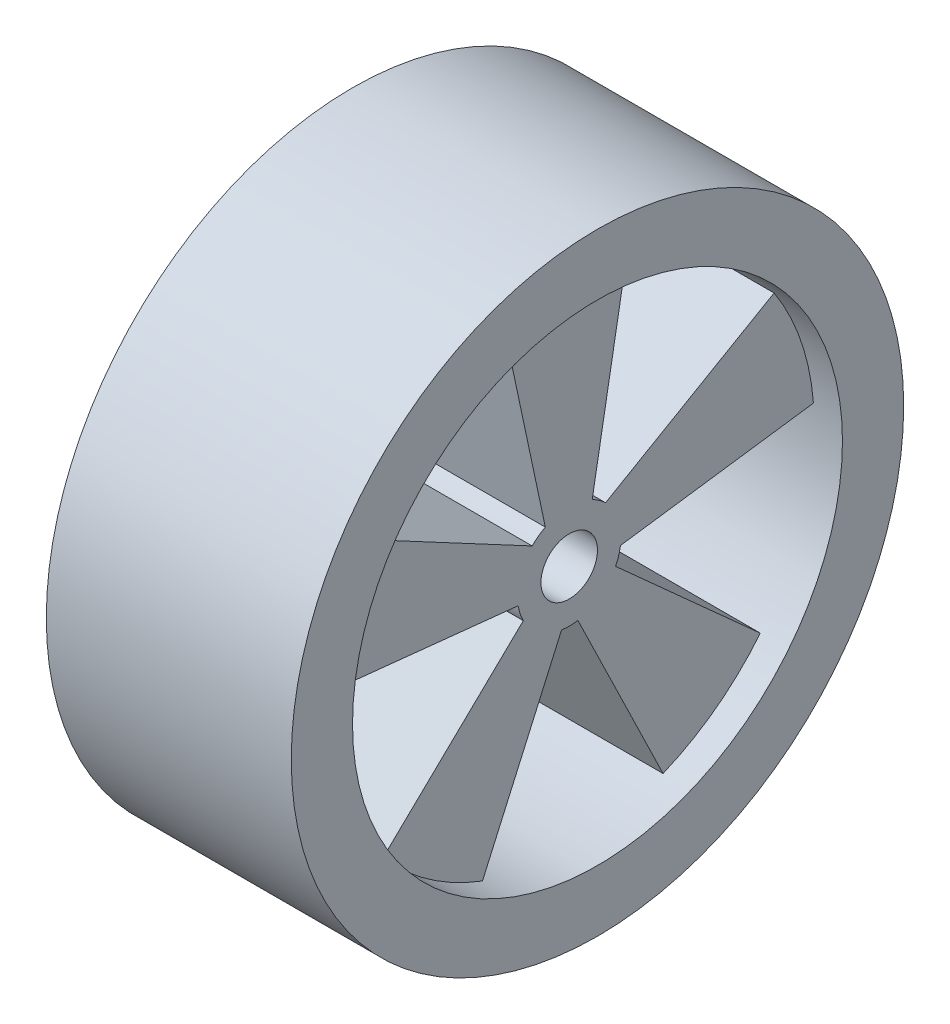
from build123d import *
from build123d.topology import SkipClean

# Parameters (mm, degrees)
SKETCH1_R               = 32.5
SKETCH1_R_2             = 26
SKETCH1_R_3             = 5.5
SKETCH1_R_4             = 3
BOSS_EXTRUDE1_DEPTH     = 26
CUT_EXTRUDE1_DEPTH      = 3
CUT_EXTRUDE1_DEPTH_BACK = 1
SKETCH2_R               = 26
CUT_EXTRUDE2_START      = -3
SKETCH3_R               = 26
CUT_EXTRUDE2_DEPTH      = 3
SCALE5_SCALE            = 5


with BuildPart() as part:
    # Sketch1 → Boss-Extrude1 (new body)
    # profile 1 of 7: a face of its own
    with BuildSketch(Plane(origin=(0, 0, 0), x_dir=(0, 0, -1), z_dir=(1, 0, 0))):
        with Locations(Location((0, 0, 0), (0, 0, 180))):
            Circle(SKETCH1_R)
        Circle(SKETCH1_R_2, mode=Mode.SUBTRACT)
    # profile 2 of 7: a face of its own
    with BuildSketch(Plane(origin=(0, 0, 0), x_dir=(0, 0, -1), z_dir=(1, 0, 0))):
        Circle(SKETCH1_R_3)
        with Locations(Location((0, 0, 0), (0, 0, 180))):
            Circle(SKETCH1_R_4, mode=Mode.SUBTRACT)
    # profile 3 of 7: a face of its own
    with BuildSketch(Plane(origin=(0, 0, 0), x_dir=(0, 0, -1), z_dir=(1, 0, 0))):
        with BuildLine():
            Line((-3.932366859, 3.845320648), (-22.17438985, 13.575582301))
            ThreePointArc((-22.17438985, 13.575582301), (-24.849421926, 7.648936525), (-25.970228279, 1.24388228))
            Line((-25.970228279, 1.24388228), (-5.424937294, -0.90556908))
            ThreePointArc((-5.424937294, -0.90556908), (-5.247144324, 1.648477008), (-3.932366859, 3.845320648))
        make_face()
    # profile 4 of 7: a face of its own
    with BuildSketch(Plane(origin=(0, 0, 0), x_dir=(0, 0, -1), z_dir=(1, 0, 0))):
        with BuildLine():
            ThreePointArc((6.058882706, 25.284183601), (-0.404322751, 25.996856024), (-6.842239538, 25.083535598))
            Line((-6.842239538, 25.083535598), (-2.537645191, 4.879585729))
            ThreePointArc((-2.537645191, 4.879585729), (-0.053661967, 5.499738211), (2.441949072, 4.928172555))
            Line((2.441949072, 4.928172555), (6.058882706, 25.284183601))
        make_face()
    # profile 5 of 7: a face of its own
    with BuildSketch(Plane(origin=(0, 0, 0), x_dir=(0, 0, -1), z_dir=(1, 0, 0))):
        with BuildLine():
            ThreePointArc((25.918985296, 2.050902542), (24.599536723, 8.418004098), (21.741491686, 14.258595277))
            Line((21.741491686, 14.258595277), (3.856586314, 3.921318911))
            ThreePointArc((3.856586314, 3.921318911), (5.072535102, 2.125885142), (5.5, 0))
            ThreePointArc((5.5, 0), (5.485374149, -0.400837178), (5.441574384, -0.799542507))
            Line((5.441574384, -0.799542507), (25.918985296, 2.050902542))
        make_face()
    # profile 6 of 7: a face of its own
    with BuildSketch(Plane(origin=(0, 0, 0), x_dir=(0, 0, -1), z_dir=(1, 0, 0))):
        with BuildLine():
            Line((20.279220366, -16.271239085), (4.921146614, -2.456077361))
            ThreePointArc((4.921146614, -2.456077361), (3.276078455, -4.417839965), (0.921128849, -5.422316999))
            Line((0.921128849, -5.422316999), (9.959931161, -24.016656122))
            ThreePointArc((9.959931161, -24.016656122), (15.607672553, -20.794243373), (20.279220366, -16.271239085))
        make_face()
    # profile 7 of 7: a face of its own
    with BuildSketch(Plane(origin=(0, 0, 0), x_dir=(0, 0, -1), z_dir=(1, 0, 0))):
        with BuildLine():
            Line((-4.872285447, -2.551633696), (-19.763409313, -16.894012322))
            ThreePointArc((-19.763409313, -16.894012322), (-14.9534646, -21.269553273), (-9.208244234, -24.314774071))
            Line((-9.208244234, -24.314774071), (-0.815150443, -5.439258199))
            ThreePointArc((-0.815150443, -5.439258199), (-3.189251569, -4.48092339), (-4.872285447, -2.551633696))
        make_face()
    extrude(amount=BOSS_EXTRUDE1_DEPTH)

    # Sketch2 → Cut-Extrude1 (cut, two sides: drawn at the far end of the back side and taken through both)
    with SkipClean():  # the faces are left unmerged after this step: merging them gives an invalid solid
        with BuildSketch(Plane(origin=(0, 0, 0), x_dir=(0, 0, -1), z_dir=(1, 0, 0)).offset(-CUT_EXTRUDE1_DEPTH_BACK)):
            with Locations(Location((0, 0, 0), (0, 0, 177.25783))):
                Circle(SKETCH2_R)
            with BuildLine():
                Line((-9.208244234, -24.314774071), (-0.815150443, -5.439258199))
                ThreePointArc((-0.815150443, -5.439258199), (0.053661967, -5.499738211), (0.921128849, -5.422316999))
                Line((0.921128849, -5.422316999), (9.959931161, -24.016656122))
                ThreePointArc((9.959931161, -24.016656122), (0.404322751, -25.996856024), (-9.208244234, -24.314774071))
            make_face()
            with BuildLine():
                Line((25.918985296, 2.050902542), (5.441574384, -0.799542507))
                ThreePointArc((5.441574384, -0.799542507), (5.247144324, -1.648477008), (4.921146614, -2.456077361))
                Line((4.921146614, -2.456077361), (20.279220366, -16.271239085))
                ThreePointArc((20.279220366, -16.271239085), (24.849421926, -7.648936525), (25.918985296, 2.050902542))
            make_face()
        extrude(amount=CUT_EXTRUDE1_DEPTH + CUT_EXTRUDE1_DEPTH_BACK, mode=Mode.SUBTRACT)

    # Sketch3 → Cut-Extrude2 (cut)
    with BuildSketch(Plane(origin=(26, 0, 0), x_dir=(0, 0, -1), z_dir=(1, 0, 0)).offset(CUT_EXTRUDE2_START)):
        Circle(SKETCH3_R)
    extrude(amount=CUT_EXTRUDE2_DEPTH, mode=Mode.SUBTRACT)


with BuildPart() as part_1:
    # Scale5: scaled about (13, 0, 0)
    add(part.part.scale(SCALE5_SCALE).moved(Location((-52, 0, 0))))


solid = part_1.part
